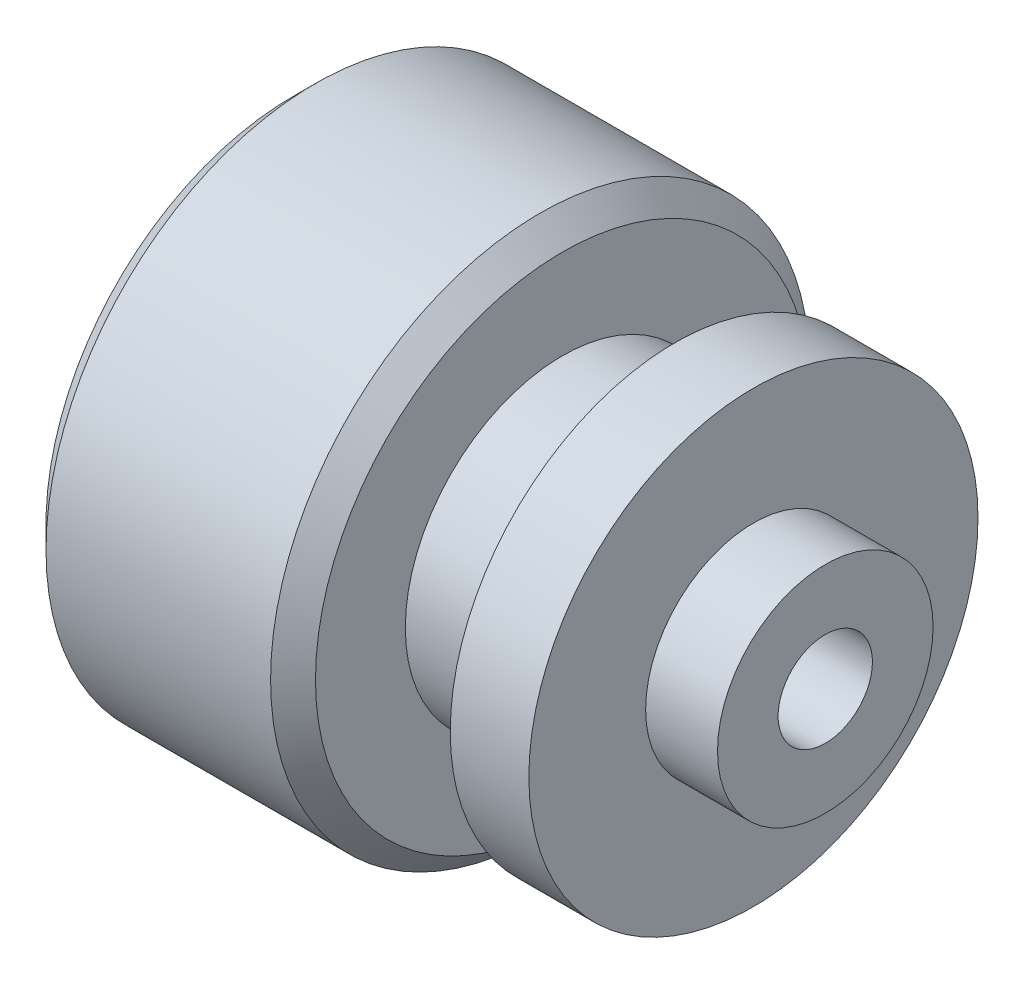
ISO-10303-21;
HEADER;
FILE_DESCRIPTION(('STEP AP214'),'2;1');
FILE_NAME('part.step','',(''),(''),'','','');
FILE_SCHEMA(('AUTOMOTIVE_DESIGN { 1 0 10303 214 1 1 1 1 }'));
ENDSEC;
DATA;
#1=APPLICATION_CONTEXT('core data for automotive mechanical design processes');
#2=APPLICATION_PROTOCOL_DEFINITION('international standard','automotive_design',2000,#1);
#3=PRODUCT_CONTEXT('',#1,'mechanical');
#4=PRODUCT('Part','Part','',(#3));
#5=PRODUCT_RELATED_PRODUCT_CATEGORY('part','',(#4));
#6=PRODUCT_DEFINITION_FORMATION('','',#4);
#7=PRODUCT_DEFINITION_CONTEXT('part definition',#1,'design');
#8=PRODUCT_DEFINITION('design','',#6,#7);
#9=PRODUCT_DEFINITION_SHAPE('','',#8);
#10=(LENGTH_UNIT() NAMED_UNIT(*) SI_UNIT(.MILLI.,.METRE.));
#11=(NAMED_UNIT(*) PLANE_ANGLE_UNIT() SI_UNIT($,.RADIAN.));
#12=(NAMED_UNIT(*) SI_UNIT($,.STERADIAN.) SOLID_ANGLE_UNIT());
#13=UNCERTAINTY_MEASURE_WITH_UNIT(LENGTH_MEASURE(1.E-05),#10,'distance_accuracy_value','');
#14=(GEOMETRIC_REPRESENTATION_CONTEXT(3) GLOBAL_UNCERTAINTY_ASSIGNED_CONTEXT((#13)) GLOBAL_UNIT_ASSIGNED_CONTEXT((#10,
#11,#12)) REPRESENTATION_CONTEXT('',''));
#15=CARTESIAN_POINT('',(0.,0.,0.));
#16=DIRECTION('',(0.,0.,1.));
#17=DIRECTION('',(1.,0.,0.));
#18=AXIS2_PLACEMENT_3D('',#15,#16,#17);
#19=CARTESIAN_POINT('',(23.7,0.,0.));
#20=DIRECTION('',(1.,0.,0.));
#21=DIRECTION('',(0.,0.,-1.));
#22=AXIS2_PLACEMENT_3D('',#19,#20,#21);
#23=CYLINDRICAL_SURFACE('',#22,2.1);
#24=CARTESIAN_POINT('',(23.7,0.,0.));
#25=DIRECTION('',(1.,0.,0.));
#26=DIRECTION('',(0.,0.,-1.));
#27=AXIS2_PLACEMENT_3D('',#24,#25,#26);
#28=CIRCLE('',#27,2.1);
#29=CARTESIAN_POINT('',(23.7,0.,-2.1));
#30=VERTEX_POINT('',#29);
#31=EDGE_CURVE('E53',#30,#30,#28,.T.);
#32=ORIENTED_EDGE('',*,*,#31,.T.);
#33=EDGE_LOOP('',(#32));
#34=FACE_BOUND('',#33,.T.);
#35=CARTESIAN_POINT('',(12.,0.,0.));
#36=DIRECTION('',(-1.,0.,0.));
#37=DIRECTION('',(0.,0.,1.));
#38=AXIS2_PLACEMENT_3D('',#35,#36,#37);
#39=CIRCLE('',#38,2.1);
#40=CARTESIAN_POINT('',(12.,0.,2.1));
#41=VERTEX_POINT('',#40);
#42=EDGE_CURVE('E50',#41,#41,#39,.F.);
#43=ORIENTED_EDGE('',*,*,#42,.F.);
#44=EDGE_LOOP('',(#43));
#45=FACE_BOUND('',#44,.T.);
#46=ADVANCED_FACE('F29',(#34,#45),#23,.F.);
#47=CARTESIAN_POINT('',(0.,0.,0.));
#48=DIRECTION('',(1.,0.,0.));
#49=DIRECTION('',(0.,0.,-1.));
#50=AXIS2_PLACEMENT_3D('',#47,#48,#49);
#51=PLANE('',#50);
#52=CARTESIAN_POINT('',(0.,0.,0.));
#53=DIRECTION('',(1.,0.,0.));
#54=DIRECTION('',(0.,0.,-1.));
#55=AXIS2_PLACEMENT_3D('',#52,#53,#54);
#56=CIRCLE('',#55,11.);
#57=CARTESIAN_POINT('',(0.,0.,-11.));
#58=VERTEX_POINT('',#57);
#59=EDGE_CURVE('E10',#58,#58,#56,.F.);
#60=ORIENTED_EDGE('',*,*,#59,.T.);
#61=EDGE_LOOP('',(#60));
#62=FACE_BOUND('',#61,.T.);
#63=CARTESIAN_POINT('',(0.,0.,0.));
#64=DIRECTION('',(-1.,0.,0.));
#65=DIRECTION('',(0.,0.,1.));
#66=AXIS2_PLACEMENT_3D('',#63,#64,#65);
#67=CIRCLE('',#66,2.5);
#68=CARTESIAN_POINT('',(0.,0.,2.5));
#69=VERTEX_POINT('',#68);
#70=EDGE_CURVE('E74',#69,#69,#67,.T.);
#71=ORIENTED_EDGE('',*,*,#70,.F.);
#72=EDGE_LOOP('',(#71));
#73=FACE_BOUND('',#72,.T.);
#74=ADVANCED_FACE('F90',(#62,#73),#51,.F.);
#75=CARTESIAN_POINT('',(0.,0.,0.));
#76=DIRECTION('',(-1.,0.,0.));
#77=DIRECTION('',(0.,0.,1.));
#78=AXIS2_PLACEMENT_3D('',#75,#76,#77);
#79=CYLINDRICAL_SURFACE('',#78,12.);
#80=CARTESIAN_POINT('',(11.,0.,0.));
#81=DIRECTION('',(-1.,0.,0.));
#82=DIRECTION('',(0.,0.,1.));
#83=AXIS2_PLACEMENT_3D('',#80,#81,#82);
#84=CIRCLE('',#83,12.);
#85=CARTESIAN_POINT('',(11.,0.,12.));
#86=VERTEX_POINT('',#85);
#87=EDGE_CURVE('E40',#86,#86,#84,.T.);
#88=ORIENTED_EDGE('',*,*,#87,.T.);
#89=EDGE_LOOP('',(#88));
#90=FACE_BOUND('',#89,.T.);
#91=CARTESIAN_POINT('',(1.,0.,0.));
#92=DIRECTION('',(1.,0.,0.));
#93=DIRECTION('',(0.,0.,-1.));
#94=AXIS2_PLACEMENT_3D('',#91,#92,#93);
#95=CIRCLE('',#94,12.);
#96=CARTESIAN_POINT('',(1.,0.,-12.));
#97=VERTEX_POINT('',#96);
#98=EDGE_CURVE('E44',#97,#97,#95,.T.);
#99=ORIENTED_EDGE('',*,*,#98,.T.);
#100=EDGE_LOOP('',(#99));
#101=FACE_BOUND('',#100,.T.);
#102=ADVANCED_FACE('F92',(#90,#101),#79,.T.);
#103=CARTESIAN_POINT('',(12.,12.,0.));
#104=DIRECTION('',(-1.,0.,0.));
#105=DIRECTION('',(0.,0.,1.));
#106=AXIS2_PLACEMENT_3D('',#103,#104,#105);
#107=PLANE('',#106);
#108=CARTESIAN_POINT('',(12.,0.,0.));
#109=DIRECTION('',(-1.,0.,0.));
#110=DIRECTION('',(0.,0.,1.));
#111=AXIS2_PLACEMENT_3D('',#108,#109,#110);
#112=CIRCLE('',#111,11.);
#113=CARTESIAN_POINT('',(12.,0.,11.));
#114=VERTEX_POINT('',#113);
#115=EDGE_CURVE('E36',#114,#114,#112,.F.);
#116=ORIENTED_EDGE('',*,*,#115,.T.);
#117=EDGE_LOOP('',(#116));
#118=FACE_BOUND('',#117,.T.);
#119=CARTESIAN_POINT('',(12.,0.,0.));
#120=DIRECTION('',(-1.,0.,0.));
#121=DIRECTION('',(0.,0.,1.));
#122=AXIS2_PLACEMENT_3D('',#119,#120,#121);
#123=CIRCLE('',#122,7.);
#124=CARTESIAN_POINT('',(12.,0.,7.));
#125=VERTEX_POINT('',#124);
#126=EDGE_CURVE('E49',#125,#125,#123,.T.);
#127=ORIENTED_EDGE('',*,*,#126,.T.);
#128=EDGE_LOOP('',(#127));
#129=FACE_BOUND('',#128,.T.);
#130=ADVANCED_FACE('F98',(#118,#129),#107,.F.);
#131=CARTESIAN_POINT('',(0.,0.,0.));
#132=DIRECTION('',(-1.,0.,0.));
#133=DIRECTION('',(0.,0.,1.));
#134=AXIS2_PLACEMENT_3D('',#131,#132,#133);
#135=CYLINDRICAL_SURFACE('',#134,7.);
#136=ORIENTED_EDGE('',*,*,#126,.F.);
#137=EDGE_LOOP('',(#136));
#138=FACE_BOUND('',#137,.T.);
#139=CARTESIAN_POINT('',(17.,0.,0.));
#140=DIRECTION('',(-1.,0.,0.));
#141=DIRECTION('',(0.,0.,1.));
#142=AXIS2_PLACEMENT_3D('',#139,#140,#141);
#143=CIRCLE('',#142,7.);
#144=CARTESIAN_POINT('',(17.,0.,7.));
#145=VERTEX_POINT('',#144);
#146=EDGE_CURVE('E57',#145,#145,#143,.T.);
#147=ORIENTED_EDGE('',*,*,#146,.T.);
#148=EDGE_LOOP('',(#147));
#149=FACE_BOUND('',#148,.T.);
#150=ADVANCED_FACE('F130',(#138,#149),#135,.T.);
#151=CARTESIAN_POINT('',(17.,7.,0.));
#152=DIRECTION('',(1.,0.,0.));
#153=DIRECTION('',(0.,0.,-1.));
#154=AXIS2_PLACEMENT_3D('',#151,#152,#153);
#155=PLANE('',#154);
#156=ORIENTED_EDGE('',*,*,#146,.F.);
#157=EDGE_LOOP('',(#156));
#158=FACE_BOUND('',#157,.T.);
#159=CARTESIAN_POINT('',(17.,0.,0.));
#160=DIRECTION('',(-1.,0.,0.));
#161=DIRECTION('',(0.,0.,1.));
#162=AXIS2_PLACEMENT_3D('',#159,#160,#161);
#163=CIRCLE('',#162,10.);
#164=CARTESIAN_POINT('',(17.,0.,10.));
#165=VERTEX_POINT('',#164);
#166=EDGE_CURVE('E60',#165,#165,#163,.T.);
#167=ORIENTED_EDGE('',*,*,#166,.T.);
#168=EDGE_LOOP('',(#167));
#169=FACE_BOUND('',#168,.T.);
#170=ADVANCED_FACE('F151',(#158,#169),#155,.F.);
#171=CARTESIAN_POINT('',(0.,0.,0.));
#172=DIRECTION('',(-1.,0.,0.));
#173=DIRECTION('',(0.,0.,1.));
#174=AXIS2_PLACEMENT_3D('',#171,#172,#173);
#175=CYLINDRICAL_SURFACE('',#174,10.);
#176=ORIENTED_EDGE('',*,*,#166,.F.);
#177=EDGE_LOOP('',(#176));
#178=FACE_BOUND('',#177,.T.);
#179=CARTESIAN_POINT('',(20.5,0.,0.));
#180=DIRECTION('',(-1.,0.,0.));
#181=DIRECTION('',(0.,0.,1.));
#182=AXIS2_PLACEMENT_3D('',#179,#180,#181);
#183=CIRCLE('',#182,10.);
#184=CARTESIAN_POINT('',(20.5,0.,10.));
#185=VERTEX_POINT('',#184);
#186=EDGE_CURVE('E63',#185,#185,#183,.T.);
#187=ORIENTED_EDGE('',*,*,#186,.T.);
#188=EDGE_LOOP('',(#187));
#189=FACE_BOUND('',#188,.T.);
#190=ADVANCED_FACE('F160',(#178,#189),#175,.T.);
#191=CARTESIAN_POINT('',(20.5,10.,0.));
#192=DIRECTION('',(-1.,0.,0.));
#193=DIRECTION('',(0.,0.,1.));
#194=AXIS2_PLACEMENT_3D('',#191,#192,#193);
#195=PLANE('',#194);
#196=ORIENTED_EDGE('',*,*,#186,.F.);
#197=EDGE_LOOP('',(#196));
#198=FACE_BOUND('',#197,.T.);
#199=CARTESIAN_POINT('',(20.5,0.,0.));
#200=DIRECTION('',(-1.,0.,0.));
#201=DIRECTION('',(0.,0.,1.));
#202=AXIS2_PLACEMENT_3D('',#199,#200,#201);
#203=CIRCLE('',#202,4.8);
#204=CARTESIAN_POINT('',(20.5,0.,4.8));
#205=VERTEX_POINT('',#204);
#206=EDGE_CURVE('E66',#205,#205,#203,.T.);
#207=ORIENTED_EDGE('',*,*,#206,.T.);
#208=EDGE_LOOP('',(#207));
#209=FACE_BOUND('',#208,.T.);
#210=ADVANCED_FACE('F169',(#198,#209),#195,.F.);
#211=CARTESIAN_POINT('',(0.,0.,0.));
#212=DIRECTION('',(-1.,0.,0.));
#213=DIRECTION('',(0.,0.,1.));
#214=AXIS2_PLACEMENT_3D('',#211,#212,#213);
#215=CYLINDRICAL_SURFACE('',#214,4.8);
#216=ORIENTED_EDGE('',*,*,#206,.F.);
#217=EDGE_LOOP('',(#216));
#218=FACE_BOUND('',#217,.T.);
#219=CARTESIAN_POINT('',(23.7,0.,0.));
#220=DIRECTION('',(-1.,0.,0.));
#221=DIRECTION('',(0.,0.,1.));
#222=AXIS2_PLACEMENT_3D('',#219,#220,#221);
#223=CIRCLE('',#222,4.8);
#224=CARTESIAN_POINT('',(23.7,0.,4.8));
#225=VERTEX_POINT('',#224);
#226=EDGE_CURVE('E69',#225,#225,#223,.T.);
#227=ORIENTED_EDGE('',*,*,#226,.T.);
#228=EDGE_LOOP('',(#227));
#229=FACE_BOUND('',#228,.T.);
#230=ADVANCED_FACE('F178',(#218,#229),#215,.T.);
#231=CARTESIAN_POINT('',(23.7,4.8,0.));
#232=DIRECTION('',(-1.,0.,0.));
#233=DIRECTION('',(0.,0.,1.));
#234=AXIS2_PLACEMENT_3D('',#231,#232,#233);
#235=PLANE('',#234);
#236=ORIENTED_EDGE('',*,*,#31,.F.);
#237=EDGE_LOOP('',(#236));
#238=FACE_BOUND('',#237,.T.);
#239=ORIENTED_EDGE('',*,*,#226,.F.);
#240=EDGE_LOOP('',(#239));
#241=FACE_BOUND('',#240,.T.);
#242=ADVANCED_FACE('F187',(#238,#241),#235,.F.);
#243=CARTESIAN_POINT('',(12.,0.,0.));
#244=DIRECTION('',(-1.,0.,0.));
#245=DIRECTION('',(0.,0.,1.));
#246=AXIS2_PLACEMENT_3D('',#243,#244,#245);
#247=PLANE('',#246);
#248=CARTESIAN_POINT('',(12.,0.,0.));
#249=DIRECTION('',(-1.,0.,0.));
#250=DIRECTION('',(0.,0.,1.));
#251=AXIS2_PLACEMENT_3D('',#248,#249,#250);
#252=CIRCLE('',#251,2.5);
#253=CARTESIAN_POINT('',(12.,0.,2.5));
#254=VERTEX_POINT('',#253);
#255=EDGE_CURVE('E54',#254,#254,#252,.T.);
#256=ORIENTED_EDGE('',*,*,#255,.T.);
#257=EDGE_LOOP('',(#256));
#258=FACE_BOUND('',#257,.T.);
#259=ORIENTED_EDGE('',*,*,#42,.T.);
#260=EDGE_LOOP('',(#259));
#261=FACE_BOUND('',#260,.T.);
#262=ADVANCED_FACE('F80',(#258,#261),#247,.T.);
#263=CARTESIAN_POINT('',(12.,0.,0.));
#264=DIRECTION('',(-1.,0.,0.));
#265=DIRECTION('',(0.,0.,1.));
#266=AXIS2_PLACEMENT_3D('',#263,#264,#265);
#267=CYLINDRICAL_SURFACE('',#266,2.5);
#268=ORIENTED_EDGE('',*,*,#255,.F.);
#269=EDGE_LOOP('',(#268));
#270=FACE_BOUND('',#269,.T.);
#271=ORIENTED_EDGE('',*,*,#70,.T.);
#272=EDGE_LOOP('',(#271));
#273=FACE_BOUND('',#272,.T.);
#274=ADVANCED_FACE('F83',(#270,#273),#267,.F.);
#275=CARTESIAN_POINT('',(11.,0.,0.));
#276=DIRECTION('',(-1.,0.,0.));
#277=DIRECTION('',(0.,0.,1.));
#278=AXIS2_PLACEMENT_3D('',#275,#276,#277);
#279=CONICAL_SURFACE('',#278,12.,0.785398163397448);
#280=ORIENTED_EDGE('',*,*,#115,.F.);
#281=EDGE_LOOP('',(#280));
#282=FACE_BOUND('',#281,.T.);
#283=ORIENTED_EDGE('',*,*,#87,.F.);
#284=EDGE_LOOP('',(#283));
#285=FACE_BOUND('',#284,.T.);
#286=ADVANCED_FACE('F86',(#282,#285),#279,.T.);
#287=CARTESIAN_POINT('',(0.,0.,0.));
#288=DIRECTION('',(1.,0.,0.));
#289=DIRECTION('',(0.,0.,-1.));
#290=AXIS2_PLACEMENT_3D('',#287,#288,#289);
#291=CONICAL_SURFACE('',#290,11.,0.785398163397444);
#292=ORIENTED_EDGE('',*,*,#98,.F.);
#293=EDGE_LOOP('',(#292));
#294=FACE_BOUND('',#293,.T.);
#295=ORIENTED_EDGE('',*,*,#59,.F.);
#296=EDGE_LOOP('',(#295));
#297=FACE_BOUND('',#296,.T.);
#298=ADVANCED_FACE('F31',(#294,#297),#291,.T.);
#299=CLOSED_SHELL('',(#46,#74,#102,#130,#150,#170,#190,#210,#230,#242,#262,#274,#286,#298));
#300=MANIFOLD_SOLID_BREP('B2',#299);
#301=ADVANCED_BREP_SHAPE_REPRESENTATION('',(#18,#300),#14);
#302=SHAPE_DEFINITION_REPRESENTATION(#9,#301);
ENDSEC;
END-ISO-10303-21;
